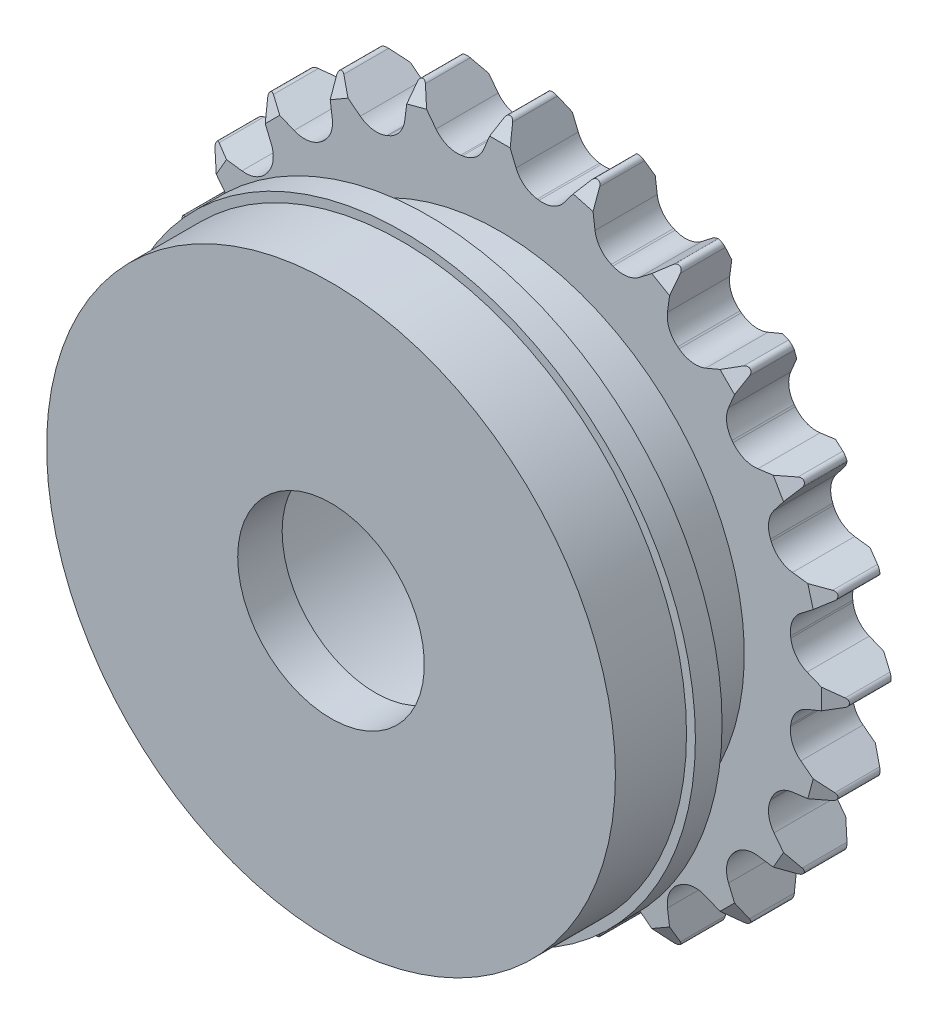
from build123d import *

# Parameters (mm, degrees)
ESQUISSE1_R                        = 33
BASE_EXTRUSION_DEPTH               = 26
ENL_V_START                        = -8
ESQUISSE2_R                        = 33
ESQUISSE2_R_2                      = 32
ENL_V_MAT_EXTRU_1_DEPTH            = 8
ESQUISSE3_R                        = 24.5
ENL_V_MAT_EXTRU_2_DEPTH            = 5
ESQUISSE4_R                        = 17.5
ENL_V_MAT_EXTRU_3_DEPTH            = 14
ESQUISSE5_R                        = 16.5
ENL_V_MAT_EXTRU_4_DEPTH            = 2
ESQUISSE6_R                        = 10.5
ENL_V_MAT_EXTRU_5_DEPTH            = 52.176166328
R_P_TITION_CIRCULAIRE1_COUNT       = 3
ESQUISSE14_R                       = 33
ESQUISSE14_R_2                     = 27.5
ENL_V_MAT_EXTRU_6_DEPTH            = 8
BOSS_EXTRU_2_DEPTH                 = 7
CONG_1_R                           = 0.5
CONG_2_R                           = 3
CONG_3_R                           = 3
ENL_V_MAT_EXTRU_7_DEPTH            = 3
R_P_TITION_CIRCULAIRE6_COUNT       = 24
CONG_1_OF_R_P_TITION_CIRCULAIRE6_R = 0.5
CONG_2_OF_R_P_TITION_CIRCULAIRE6_R = 3
CONG_3_OF_R_P_TITION_CIRCULAIRE6_R = 3


with BuildPart() as part:
    # Esquisse1 → Base-Extrusion (new body)
    with BuildSketch(Plane.XY):
        with Locations(Location((0, 0, 0), (0, 0, 180))):
            Circle(ESQUISSE1_R)
    extrude(amount=BASE_EXTRUSION_DEPTH)

    # Esquisse2 → Enl_v. mat.-Extru.1 (cut)
    with BuildSketch(Plane.XY.offset(26).offset(ENL_V_START)):
        with Locations(Location((0, 0, 0), (0, 0, 180))):
            Circle(ESQUISSE2_R)
        Circle(ESQUISSE2_R_2, mode=Mode.SUBTRACT)
    extrude(amount=ENL_V_MAT_EXTRU_1_DEPTH, mode=Mode.SUBTRACT)

    # Esquisse3 → Enl_v. mat.-Extru.2 (cut)
    with BuildSketch(Plane(origin=(0, 0, 0), x_dir=(-1, 0, 0), z_dir=(0, 0, -1))):
        Circle(ESQUISSE3_R)
    extrude(amount=-ENL_V_MAT_EXTRU_2_DEPTH, mode=Mode.SUBTRACT)

    # Esquisse4 → Enl_v. mat.-Extru.3 (cut)
    with BuildSketch(Plane(origin=(0, 0, 5), x_dir=(-1, 0, 0), z_dir=(0, 0, -1))):
        Circle(ESQUISSE4_R)
    extrude(amount=-ENL_V_MAT_EXTRU_3_DEPTH, mode=Mode.SUBTRACT)

    # Esquisse5 → Enl_v. mat.-Extru.4 (cut)
    with BuildSketch(Plane(origin=(0, 0, 19), x_dir=(-1, 0, 0), z_dir=(0, 0, -1))):
        Circle(ESQUISSE5_R)
    extrude(amount=-ENL_V_MAT_EXTRU_4_DEPTH, mode=Mode.SUBTRACT)

    # Esquisse6 → Enl_v. mat.-Extru.5 (cut, through all)
    with BuildSketch(Plane(origin=(0, 0, 21), x_dir=(-1, 0, 0), z_dir=(0, 0, -1))):
        Circle(ESQUISSE6_R)
    extrude(amount=-ENL_V_MAT_EXTRU_5_DEPTH, mode=Mode.SUBTRACT)

    # Esquisse12 → Trou taraud_ M3.5x0.63 (revolve, cut)
    with BuildSketch(Plane(origin=(0, 20, 5), x_dir=(0, 1, 0), z_dir=(1, 0, 0))):
        Polygon((0, 0), (0, 10.751075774), (1.25, 10), (1.25, 7), (1.5, 7), (1.5, 0), align=None)
    trou_taraud_m3_5x0_63 = revolve(axis=Axis((0, 20, -1.35), (0, 0, 1)), mode=Mode.SUBTRACT)

    # R_p_tition circulaire1: Trou taraud_ M3.5x0.63 ×3 about axis
    r_p_tition_circulaire1_axis = Axis((0, 0, 0), (0, 0, 1))
    for i in range(1, R_P_TITION_CIRCULAIRE1_COUNT):
        add(trou_taraud_m3_5x0_63.rotate(r_p_tition_circulaire1_axis, i * 360 / R_P_TITION_CIRCULAIRE1_COUNT), mode=Mode.SUBTRACT)

    # Esquisse14 → Enl_v. mat.-Extru.6 (cut)
    with BuildSketch(Plane(origin=(0, 0, 7), x_dir=(-1, 0, 0), z_dir=(0, 0, -1))):
        Circle(ESQUISSE14_R)
        Circle(ESQUISSE14_R_2, mode=Mode.SUBTRACT)
    extrude(amount=-ENL_V_MAT_EXTRU_6_DEPTH, mode=Mode.SUBTRACT)

    # Esquisse15 → Boss.-Extru.2 (add)
    with BuildSketch(Plane(origin=(0, 0, 0), x_dir=(-1, 0, 0), z_dir=(0, 0, -1))):
        with BuildLine():
            Line((2.5, 32.905166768), (0, 39))
            Line((0, 39), (-2.5, 32.905166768))
            ThreePointArc((-2.5, 32.905166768), (0, 33), (2.5, 32.905166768))
        make_face()
    boss_extru_2 = extrude(amount=-BOSS_EXTRU_2_DEPTH)

    # Cong_1
    cong_1_edges = [part.edges().sort_by_distance(p)[0] for p in [
        (0, 39, 3.5),
    ]]
    fillet(cong_1_edges, radius=CONG_1_R)

    # Cong_2
    cong_2_edges = [part.edges().sort_by_distance(p)[0] for p in [
        (2.5, 32.905166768, 3.5),
    ]]
    fillet(cong_2_edges, radius=CONG_2_R)

    # Cong_3
    cong_3_edges = [part.edges().sort_by_distance(p)[0] for p in [
        (-2.5, 32.905166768, 3.5),
    ]]
    fillet(cong_3_edges, radius=CONG_3_R)

    # Esquisse16 → Enl_v. mat.-Extru.7 (cut, symmetric)
    with BuildSketch(Plane(origin=(0, 0, 0), x_dir=(0, 0, -1), z_dir=(1, 0, 0))):
        Polygon((0, 38.182472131), (-1.154700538, 38.182472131), (0, 36.182472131), align=None)
        Polygon((-7, 38.182472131), (-7, 36.182472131), (-5.845299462, 38.182472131), align=None)
    enl_v_mat_extru_7 = extrude(amount=ENL_V_MAT_EXTRU_7_DEPTH, both=True, mode=Mode.SUBTRACT)

    # R_p_tition circulaire6: Boss.-Extru.2, Enl_v. mat.-Extru.7 ×24 about axis
    r_p_tition_circulaire6_axis = Axis((0, 0, 0), (0, 0, 1))
    add([boss_extru_2.rotate(r_p_tition_circulaire6_axis, i * 360 / R_P_TITION_CIRCULAIRE6_COUNT) for i in range(1, R_P_TITION_CIRCULAIRE6_COUNT)])
    add([enl_v_mat_extru_7.rotate(r_p_tition_circulaire6_axis, i * 360 / R_P_TITION_CIRCULAIRE6_COUNT) for i in range(1, R_P_TITION_CIRCULAIRE6_COUNT)], mode=Mode.SUBTRACT)

    # Cong_1 of R_p_tition circulaire6
    cong_1_of_r_p_tition_circulaire6_edges = [part.edges().sort_by_distance(p)[0] for p in [
        (-10.093942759, 37.671107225, 3.5),
        (-19.5, 33.774990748, 3.5),
        (-27.577164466, 27.577164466, 3.5),
        (-33.774990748, 19.5, 3.5),
        (-37.671107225, 10.093942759, 3.5),
        (-39, 0, 3.5),
        (-37.671107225, -10.093942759, 3.5),
        (-33.774990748, -19.5, 3.5),
        (-27.577164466, -27.577164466, 3.5),
        (-19.5, -33.774990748, 3.5),
        (-10.093942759, -37.671107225, 3.5),
        (0, -39, 3.5),
        (10.093942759, -37.671107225, 3.5),
        (19.5, -33.774990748, 3.5),
        (27.577164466, -27.577164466, 3.5),
        (33.774990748, -19.5, 3.5),
        (37.671107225, -10.093942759, 3.5),
        (39, 0, 3.5),
        (37.671107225, 10.093942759, 3.5),
        (33.774990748, 19.5, 3.5),
        (27.577164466, 27.577164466, 3.5),
        (19.5, 33.774990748, 3.5),
        (10.093942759, 37.671107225, 3.5),
    ]]
    fillet(cong_1_of_r_p_tition_circulaire6_edges, radius=CONG_1_OF_R_P_TITION_CIRCULAIRE6_R)

    # Cong_2 of R_p_tition circulaire6
    cong_2_of_r_p_tition_circulaire6_edges = [part.edges().sort_by_distance(p)[0] for p in [
        (-6.101669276, 32.430998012, 3.5),
        (-14.287519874, 29.746710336, 3.5),
        (-21.499699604, 25.03523351, 3.5),
        (-27.246710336, 18.617646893, 3.5),
        (-31.136902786, 10.931298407, 3.5),
        (-32.905166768, 2.5, 3.5),
        (-32.430998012, -6.101669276, 3.5),
        (-29.746710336, -14.287519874, 3.5),
        (-25.03523351, -21.499699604, 3.5),
        (-18.617646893, -27.246710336, 3.5),
        (-10.931298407, -31.136902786, 3.5),
        (-2.5, -32.905166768, 3.5),
        (6.101669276, -32.430998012, 3.5),
        (14.287519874, -29.746710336, 3.5),
        (21.499699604, -25.03523351, 3.5),
        (27.246710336, -18.617646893, 3.5),
        (31.136902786, -10.931298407, 3.5),
        (32.905166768, -2.5, 3.5),
        (32.430998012, 6.101669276, 3.5),
        (29.746710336, 14.287519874, 3.5),
        (25.03523351, 21.499699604, 3.5),
        (18.617646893, 27.246710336, 3.5),
        (10.931298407, 31.136902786, 3.5),
    ]]
    fillet(cong_2_of_r_p_tition_circulaire6_edges, radius=CONG_2_OF_R_P_TITION_CIRCULAIRE6_R)

    # Cong_3 of R_p_tition circulaire6
    cong_3_of_r_p_tition_circulaire6_edges = [part.edges().sort_by_distance(p)[0] for p in [
        (-10.931298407, 31.136902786, 3.5),
        (-18.617646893, 27.246710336, 3.5),
        (-25.03523351, 21.499699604, 3.5),
        (-29.746710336, 14.287519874, 3.5),
        (-32.430998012, 6.101669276, 3.5),
        (-32.905166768, -2.5, 3.5),
        (-31.136902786, -10.931298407, 3.5),
        (-27.246710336, -18.617646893, 3.5),
        (-21.499699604, -25.03523351, 3.5),
        (-14.287519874, -29.746710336, 3.5),
        (-6.101669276, -32.430998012, 3.5),
        (2.5, -32.905166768, 3.5),
        (10.931298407, -31.136902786, 3.5),
        (18.617646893, -27.246710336, 3.5),
        (25.03523351, -21.499699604, 3.5),
        (29.746710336, -14.287519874, 3.5),
        (32.430998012, -6.101669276, 3.5),
        (32.905166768, 2.5, 3.5),
        (31.136902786, 10.931298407, 3.5),
        (27.246710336, 18.617646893, 3.5),
        (21.499699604, 25.03523351, 3.5),
        (14.287519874, 29.746710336, 3.5),
        (6.101669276, 32.430998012, 3.5),
    ]]
    fillet(cong_3_of_r_p_tition_circulaire6_edges, radius=CONG_3_OF_R_P_TITION_CIRCULAIRE6_R)


solid = part.part
